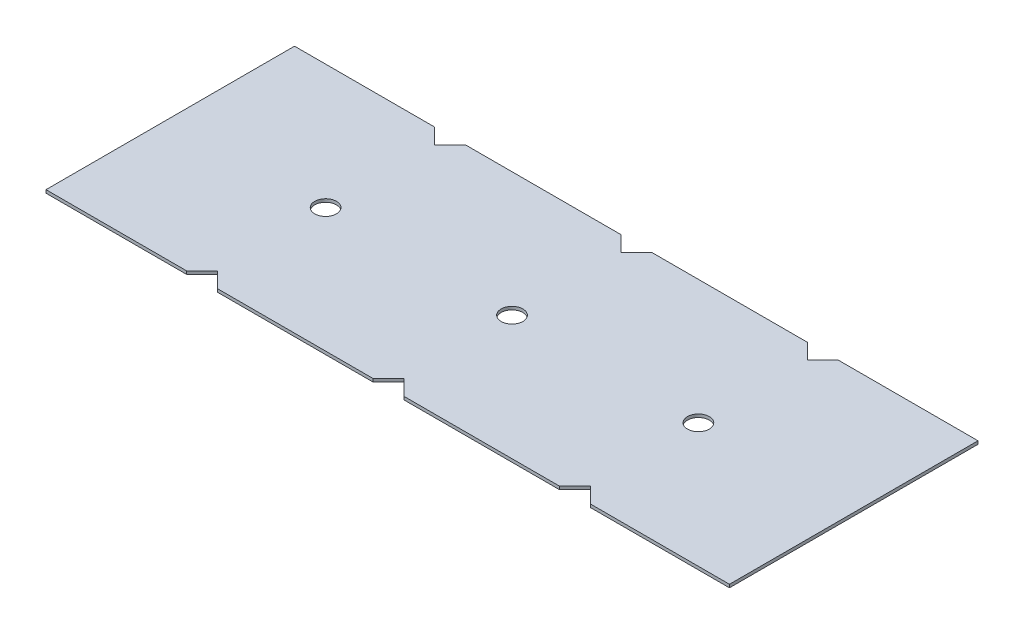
ISO-10303-21;
HEADER;
FILE_DESCRIPTION(('STEP AP214'),'2;1');
FILE_NAME('part.step','',(''),(''),'','','');
FILE_SCHEMA(('AUTOMOTIVE_DESIGN { 1 0 10303 214 1 1 1 1 }'));
ENDSEC;
DATA;
#1=APPLICATION_CONTEXT('core data for automotive mechanical design processes');
#2=APPLICATION_PROTOCOL_DEFINITION('international standard','automotive_design',2000,#1);
#3=PRODUCT_CONTEXT('',#1,'mechanical');
#4=PRODUCT('Part','Part','',(#3));
#5=PRODUCT_RELATED_PRODUCT_CATEGORY('part','',(#4));
#6=PRODUCT_DEFINITION_FORMATION('','',#4);
#7=PRODUCT_DEFINITION_CONTEXT('part definition',#1,'design');
#8=PRODUCT_DEFINITION('design','',#6,#7);
#9=PRODUCT_DEFINITION_SHAPE('','',#8);
#10=(LENGTH_UNIT() NAMED_UNIT(*) SI_UNIT(.MILLI.,.METRE.));
#11=(NAMED_UNIT(*) PLANE_ANGLE_UNIT() SI_UNIT($,.RADIAN.));
#12=(NAMED_UNIT(*) SI_UNIT($,.STERADIAN.) SOLID_ANGLE_UNIT());
#13=UNCERTAINTY_MEASURE_WITH_UNIT(LENGTH_MEASURE(1.E-05),#10,'distance_accuracy_value','');
#14=(GEOMETRIC_REPRESENTATION_CONTEXT(3) GLOBAL_UNCERTAINTY_ASSIGNED_CONTEXT((#13)) GLOBAL_UNIT_ASSIGNED_CONTEXT((#10,
#11,#12)) REPRESENTATION_CONTEXT('',''));
#15=CARTESIAN_POINT('',(0.,0.,0.));
#16=DIRECTION('',(0.,0.,1.));
#17=DIRECTION('',(1.,0.,0.));
#18=AXIS2_PLACEMENT_3D('',#15,#16,#17);
#19=CARTESIAN_POINT('',(0.,1.,0.));
#20=DIRECTION('',(0.,0.,-1.));
#21=DIRECTION('',(-1.,0.,0.));
#22=AXIS2_PLACEMENT_3D('',#19,#20,#21);
#23=PLANE('',#22);
#24=DIRECTION('',(-1.,0.,0.));
#25=VECTOR('',#24,1.);
#26=CARTESIAN_POINT('',(0.,1.,0.));
#27=LINE('',#26,#25);
#28=CARTESIAN_POINT('',(105.280404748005,1.,0.));
#29=VERTEX_POINT('',#28);
#30=CARTESIAN_POINT('',(55.2804047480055,1.,0.));
#31=VERTEX_POINT('',#30);
#32=EDGE_CURVE('E344',#29,#31,#27,.T.);
#33=ORIENTED_EDGE('',*,*,#32,.T.);
#34=DIRECTION('',(0.,1.,0.));
#35=VECTOR('',#34,1.);
#36=CARTESIAN_POINT('',(55.2804047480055,0.,0.));
#37=LINE('',#36,#35);
#38=CARTESIAN_POINT('',(55.2804047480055,0.,0.));
#39=VERTEX_POINT('',#38);
#40=EDGE_CURVE('E327',#39,#31,#37,.T.);
#41=ORIENTED_EDGE('',*,*,#40,.F.);
#42=DIRECTION('',(1.,0.,0.));
#43=VECTOR('',#42,1.);
#44=CARTESIAN_POINT('',(0.,0.,0.));
#45=LINE('',#44,#43);
#46=CARTESIAN_POINT('',(105.280404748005,0.,0.));
#47=VERTEX_POINT('',#46);
#48=EDGE_CURVE('E203',#39,#47,#45,.T.);
#49=ORIENTED_EDGE('',*,*,#48,.T.);
#50=DIRECTION('',(0.,1.,0.));
#51=VECTOR('',#50,1.);
#52=CARTESIAN_POINT('',(105.280404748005,0.,0.));
#53=LINE('',#52,#51);
#54=EDGE_CURVE('E296',#47,#29,#53,.T.);
#55=ORIENTED_EDGE('',*,*,#54,.T.);
#56=EDGE_LOOP('',(#33,#41,#49,#55));
#57=FACE_BOUND('',#56,.T.);
#58=ADVANCED_FACE('F31',(#57),#23,.F.);
#59=CARTESIAN_POINT('',(220.,1.,0.));
#60=VERTEX_POINT('',#59);
#61=CARTESIAN_POINT('',(175.280404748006,1.,0.));
#62=VERTEX_POINT('',#61);
#63=EDGE_CURVE('E347',#60,#62,#27,.T.);
#64=ORIENTED_EDGE('',*,*,#63,.T.);
#65=DIRECTION('',(0.,1.,0.));
#66=VECTOR('',#65,1.);
#67=CARTESIAN_POINT('',(175.280404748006,0.,0.));
#68=LINE('',#67,#66);
#69=CARTESIAN_POINT('',(175.280404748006,0.,0.));
#70=VERTEX_POINT('',#69);
#71=EDGE_CURVE('E312',#70,#62,#68,.T.);
#72=ORIENTED_EDGE('',*,*,#71,.F.);
#73=CARTESIAN_POINT('',(220.,0.,0.));
#74=VERTEX_POINT('',#73);
#75=EDGE_CURVE('E209',#70,#74,#45,.T.);
#76=ORIENTED_EDGE('',*,*,#75,.T.);
#77=DIRECTION('',(0.,1.,0.));
#78=VECTOR('',#77,1.);
#79=CARTESIAN_POINT('',(220.,0.,0.));
#80=LINE('',#79,#78);
#81=EDGE_CURVE('E202',#74,#60,#80,.T.);
#82=ORIENTED_EDGE('',*,*,#81,.T.);
#83=EDGE_LOOP('',(#64,#72,#76,#82));
#84=FACE_BOUND('',#83,.T.);
#85=ADVANCED_FACE('F416',(#84),#23,.F.);
#86=CARTESIAN_POINT('',(115.280404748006,0.,0.));
#87=VERTEX_POINT('',#86);
#88=CARTESIAN_POINT('',(165.280404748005,0.,0.));
#89=VERTEX_POINT('',#88);
#90=EDGE_CURVE('E205',#87,#89,#45,.T.);
#91=ORIENTED_EDGE('',*,*,#90,.T.);
#92=DIRECTION('',(0.,1.,0.));
#93=VECTOR('',#92,1.);
#94=CARTESIAN_POINT('',(165.280404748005,0.,0.));
#95=LINE('',#94,#93);
#96=CARTESIAN_POINT('',(165.280404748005,1.,0.));
#97=VERTEX_POINT('',#96);
#98=EDGE_CURVE('E56',#89,#97,#95,.T.);
#99=ORIENTED_EDGE('',*,*,#98,.T.);
#100=CARTESIAN_POINT('',(115.280404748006,1.,0.));
#101=VERTEX_POINT('',#100);
#102=EDGE_CURVE('E346',#97,#101,#27,.T.);
#103=ORIENTED_EDGE('',*,*,#102,.T.);
#104=DIRECTION('',(0.,1.,0.));
#105=VECTOR('',#104,1.);
#106=CARTESIAN_POINT('',(115.280404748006,0.,0.));
#107=LINE('',#106,#105);
#108=EDGE_CURVE('E293',#87,#101,#107,.T.);
#109=ORIENTED_EDGE('',*,*,#108,.F.);
#110=EDGE_LOOP('',(#91,#99,#103,#109));
#111=FACE_BOUND('',#110,.T.);
#112=ADVANCED_FACE('F424',(#111),#23,.F.);
#113=CARTESIAN_POINT('',(0.,1.,-80.));
#114=DIRECTION('',(0.,0.,-1.));
#115=DIRECTION('',(-1.,0.,0.));
#116=AXIS2_PLACEMENT_3D('',#113,#114,#115);
#117=PLANE('',#116);
#118=DIRECTION('',(0.,1.,0.));
#119=VECTOR('',#118,1.);
#120=CARTESIAN_POINT('',(55.0794565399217,0.,-80.));
#121=LINE('',#120,#119);
#122=CARTESIAN_POINT('',(55.0794565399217,0.,-80.));
#123=VERTEX_POINT('',#122);
#124=CARTESIAN_POINT('',(55.0794565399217,1.,-80.));
#125=VERTEX_POINT('',#124);
#126=EDGE_CURVE('E278',#123,#125,#121,.T.);
#127=ORIENTED_EDGE('',*,*,#126,.T.);
#128=DIRECTION('',(-1.,0.,0.));
#129=VECTOR('',#128,1.);
#130=CARTESIAN_POINT('',(0.,1.,-80.));
#131=LINE('',#130,#129);
#132=CARTESIAN_POINT('',(105.079456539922,1.,-80.));
#133=VERTEX_POINT('',#132);
#134=EDGE_CURVE('E369',#133,#125,#131,.T.);
#135=ORIENTED_EDGE('',*,*,#134,.F.);
#136=DIRECTION('',(0.,1.,0.));
#137=VECTOR('',#136,1.);
#138=CARTESIAN_POINT('',(105.079456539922,0.,-80.));
#139=LINE('',#138,#137);
#140=CARTESIAN_POINT('',(105.079456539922,0.,-80.));
#141=VERTEX_POINT('',#140);
#142=EDGE_CURVE('E239',#141,#133,#139,.T.);
#143=ORIENTED_EDGE('',*,*,#142,.F.);
#144=DIRECTION('',(1.,0.,0.));
#145=VECTOR('',#144,1.);
#146=CARTESIAN_POINT('',(0.,0.,-80.));
#147=LINE('',#146,#145);
#148=EDGE_CURVE('E358',#123,#141,#147,.T.);
#149=ORIENTED_EDGE('',*,*,#148,.F.);
#150=EDGE_LOOP('',(#127,#135,#143,#149));
#151=FACE_BOUND('',#150,.T.);
#152=ADVANCED_FACE('F391',(#151),#117,.T.);
#153=DIRECTION('',(0.,1.,0.));
#154=VECTOR('',#153,1.);
#155=CARTESIAN_POINT('',(175.079456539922,0.,-80.));
#156=LINE('',#155,#154);
#157=CARTESIAN_POINT('',(175.079456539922,0.,-80.));
#158=VERTEX_POINT('',#157);
#159=CARTESIAN_POINT('',(175.079456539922,1.,-80.));
#160=VERTEX_POINT('',#159);
#161=EDGE_CURVE('E260',#158,#160,#156,.T.);
#162=ORIENTED_EDGE('',*,*,#161,.T.);
#163=CARTESIAN_POINT('',(220.,1.,-80.));
#164=VERTEX_POINT('',#163);
#165=EDGE_CURVE('E366',#164,#160,#131,.T.);
#166=ORIENTED_EDGE('',*,*,#165,.F.);
#167=DIRECTION('',(0.,1.,0.));
#168=VECTOR('',#167,1.);
#169=CARTESIAN_POINT('',(220.,0.,-80.));
#170=LINE('',#169,#168);
#171=CARTESIAN_POINT('',(220.,0.,-80.));
#172=VERTEX_POINT('',#171);
#173=EDGE_CURVE('E362',#172,#164,#170,.T.);
#174=ORIENTED_EDGE('',*,*,#173,.F.);
#175=EDGE_CURVE('E353',#158,#172,#147,.T.);
#176=ORIENTED_EDGE('',*,*,#175,.F.);
#177=EDGE_LOOP('',(#162,#166,#174,#176));
#178=FACE_BOUND('',#177,.T.);
#179=ADVANCED_FACE('F412',(#178),#117,.T.);
#180=DIRECTION('',(0.,1.,0.));
#181=VECTOR('',#180,1.);
#182=CARTESIAN_POINT('',(165.079456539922,0.,-80.));
#183=LINE('',#182,#181);
#184=CARTESIAN_POINT('',(165.079456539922,0.,-80.));
#185=VERTEX_POINT('',#184);
#186=CARTESIAN_POINT('',(165.079456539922,1.,-80.));
#187=VERTEX_POINT('',#186);
#188=EDGE_CURVE('E265',#185,#187,#183,.T.);
#189=ORIENTED_EDGE('',*,*,#188,.F.);
#190=CARTESIAN_POINT('',(115.079456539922,0.,-80.));
#191=VERTEX_POINT('',#190);
#192=EDGE_CURVE('E356',#191,#185,#147,.T.);
#193=ORIENTED_EDGE('',*,*,#192,.F.);
#194=DIRECTION('',(0.,1.,0.));
#195=VECTOR('',#194,1.);
#196=CARTESIAN_POINT('',(115.079456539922,0.,-80.));
#197=LINE('',#196,#195);
#198=CARTESIAN_POINT('',(115.079456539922,1.,-80.));
#199=VERTEX_POINT('',#198);
#200=EDGE_CURVE('E238',#191,#199,#197,.T.);
#201=ORIENTED_EDGE('',*,*,#200,.T.);
#202=EDGE_CURVE('E368',#187,#199,#131,.T.);
#203=ORIENTED_EDGE('',*,*,#202,.F.);
#204=EDGE_LOOP('',(#189,#193,#201,#203));
#205=FACE_BOUND('',#204,.T.);
#206=ADVANCED_FACE('F399',(#205),#117,.T.);
#207=CARTESIAN_POINT('',(0.,0.,-80.));
#208=DIRECTION('',(-1.,0.,0.));
#209=DIRECTION('',(0.,0.,1.));
#210=AXIS2_PLACEMENT_3D('',#207,#208,#209);
#211=PLANE('',#210);
#212=DIRECTION('',(0.,-1.,0.));
#213=VECTOR('',#212,1.);
#214=CARTESIAN_POINT('',(0.,0.,0.));
#215=LINE('',#214,#213);
#216=CARTESIAN_POINT('',(0.,1.,0.));
#217=VERTEX_POINT('',#216);
#218=CARTESIAN_POINT('',(0.,0.,0.));
#219=VERTEX_POINT('',#218);
#220=EDGE_CURVE('E201',#217,#219,#215,.T.);
#221=ORIENTED_EDGE('',*,*,#220,.F.);
#222=DIRECTION('',(0.,0.,1.));
#223=VECTOR('',#222,1.);
#224=CARTESIAN_POINT('',(0.,1.,-80.));
#225=LINE('',#224,#223);
#226=CARTESIAN_POINT('',(0.,1.,-80.));
#227=VERTEX_POINT('',#226);
#228=EDGE_CURVE('E11',#227,#217,#225,.T.);
#229=ORIENTED_EDGE('',*,*,#228,.F.);
#230=DIRECTION('',(0.,-1.,0.));
#231=VECTOR('',#230,1.);
#232=CARTESIAN_POINT('',(0.,0.,-80.));
#233=LINE('',#232,#231);
#234=CARTESIAN_POINT('',(0.,0.,-80.));
#235=VERTEX_POINT('',#234);
#236=EDGE_CURVE('E350',#227,#235,#233,.T.);
#237=ORIENTED_EDGE('',*,*,#236,.T.);
#238=DIRECTION('',(0.,0.,1.));
#239=VECTOR('',#238,1.);
#240=CARTESIAN_POINT('',(0.,0.,-80.));
#241=LINE('',#240,#239);
#242=EDGE_CURVE('E35',#235,#219,#241,.T.);
#243=ORIENTED_EDGE('',*,*,#242,.T.);
#244=EDGE_LOOP('',(#221,#229,#237,#243));
#245=FACE_BOUND('',#244,.T.);
#246=ADVANCED_FACE('F33',(#245),#211,.T.);
#247=CARTESIAN_POINT('',(0.,1.,-80.));
#248=DIRECTION('',(0.,1.,0.));
#249=DIRECTION('',(0.,0.,1.));
#250=AXIS2_PLACEMENT_3D('',#247,#248,#249);
#251=PLANE('',#250);
#252=DIRECTION('',(-0.707106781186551,0.,-0.707106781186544));
#253=VECTOR('',#252,1.);
#254=CARTESIAN_POINT('',(50.2804047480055,1.,-5.00000000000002));
#255=LINE('',#254,#253);
#256=CARTESIAN_POINT('',(50.2804047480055,1.,-5.00000000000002));
#257=VERTEX_POINT('',#256);
#258=EDGE_CURVE('E330',#31,#257,#255,.T.);
#259=ORIENTED_EDGE('',*,*,#258,.F.);
#260=ORIENTED_EDGE('',*,*,#32,.F.);
#261=DIRECTION('',(-0.707106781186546,0.,0.707106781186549));
#262=VECTOR('',#261,1.);
#263=CARTESIAN_POINT('',(110.280404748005,1.,-5.00000000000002));
#264=LINE('',#263,#262);
#265=CARTESIAN_POINT('',(110.280404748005,1.,-5.00000000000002));
#266=VERTEX_POINT('',#265);
#267=EDGE_CURVE('E307',#266,#29,#264,.T.);
#268=ORIENTED_EDGE('',*,*,#267,.F.);
#269=DIRECTION('',(-0.707106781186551,0.,-0.707106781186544));
#270=VECTOR('',#269,1.);
#271=CARTESIAN_POINT('',(110.280404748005,1.,-5.00000000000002));
#272=LINE('',#271,#270);
#273=EDGE_CURVE('E309',#101,#266,#272,.T.);
#274=ORIENTED_EDGE('',*,*,#273,.F.);
#275=ORIENTED_EDGE('',*,*,#102,.F.);
#276=DIRECTION('',(-0.707106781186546,0.,0.707106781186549));
#277=VECTOR('',#276,1.);
#278=CARTESIAN_POINT('',(170.280404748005,1.,-5.00000000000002));
#279=LINE('',#278,#277);
#280=CARTESIAN_POINT('',(170.280404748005,1.,-5.00000000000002));
#281=VERTEX_POINT('',#280);
#282=EDGE_CURVE('E325',#281,#97,#279,.T.);
#283=ORIENTED_EDGE('',*,*,#282,.F.);
#284=DIRECTION('',(-0.707106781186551,0.,-0.707106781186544));
#285=VECTOR('',#284,1.);
#286=CARTESIAN_POINT('',(170.280404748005,1.,-5.00000000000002));
#287=LINE('',#286,#285);
#288=EDGE_CURVE('E317',#62,#281,#287,.T.);
#289=ORIENTED_EDGE('',*,*,#288,.F.);
#290=ORIENTED_EDGE('',*,*,#63,.F.);
#291=DIRECTION('',(0.,0.,1.));
#292=VECTOR('',#291,1.);
#293=CARTESIAN_POINT('',(220.,1.,-80.));
#294=LINE('',#293,#292);
#295=EDGE_CURVE('E40',#164,#60,#294,.T.);
#296=ORIENTED_EDGE('',*,*,#295,.F.);
#297=ORIENTED_EDGE('',*,*,#165,.T.);
#298=DIRECTION('',(0.707106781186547,0.,-0.707106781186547));
#299=VECTOR('',#298,1.);
#300=CARTESIAN_POINT('',(175.079456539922,1.,-80.));
#301=LINE('',#300,#299);
#302=CARTESIAN_POINT('',(170.079456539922,1.,-75.));
#303=VERTEX_POINT('',#302);
#304=EDGE_CURVE('E263',#303,#160,#301,.T.);
#305=ORIENTED_EDGE('',*,*,#304,.F.);
#306=DIRECTION('',(0.707106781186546,0.,0.707106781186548));
#307=VECTOR('',#306,1.);
#308=CARTESIAN_POINT('',(170.079456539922,1.,-75.));
#309=LINE('',#308,#307);
#310=EDGE_CURVE('E273',#187,#303,#309,.T.);
#311=ORIENTED_EDGE('',*,*,#310,.F.);
#312=ORIENTED_EDGE('',*,*,#202,.T.);
#313=DIRECTION('',(0.707106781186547,0.,-0.707106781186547));
#314=VECTOR('',#313,1.);
#315=CARTESIAN_POINT('',(115.079456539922,1.,-80.));
#316=LINE('',#315,#314);
#317=CARTESIAN_POINT('',(110.079456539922,1.,-75.));
#318=VERTEX_POINT('',#317);
#319=EDGE_CURVE('E251',#318,#199,#316,.T.);
#320=ORIENTED_EDGE('',*,*,#319,.F.);
#321=DIRECTION('',(0.707106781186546,0.,0.707106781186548));
#322=VECTOR('',#321,1.);
#323=CARTESIAN_POINT('',(110.079456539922,1.,-75.));
#324=LINE('',#323,#322);
#325=EDGE_CURVE('E254',#133,#318,#324,.T.);
#326=ORIENTED_EDGE('',*,*,#325,.F.);
#327=ORIENTED_EDGE('',*,*,#134,.T.);
#328=DIRECTION('',(0.707106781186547,0.,-0.707106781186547));
#329=VECTOR('',#328,1.);
#330=CARTESIAN_POINT('',(55.0794565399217,1.,-80.));
#331=LINE('',#330,#329);
#332=CARTESIAN_POINT('',(50.0794565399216,1.,-75.));
#333=VERTEX_POINT('',#332);
#334=EDGE_CURVE('E281',#333,#125,#331,.T.);
#335=ORIENTED_EDGE('',*,*,#334,.F.);
#336=DIRECTION('',(0.707106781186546,0.,0.707106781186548));
#337=VECTOR('',#336,1.);
#338=CARTESIAN_POINT('',(50.0794565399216,1.,-75.));
#339=LINE('',#338,#337);
#340=CARTESIAN_POINT('',(45.0794565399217,1.,-80.));
#341=VERTEX_POINT('',#340);
#342=EDGE_CURVE('E291',#341,#333,#339,.T.);
#343=ORIENTED_EDGE('',*,*,#342,.F.);
#344=EDGE_CURVE('E365',#341,#227,#131,.T.);
#345=ORIENTED_EDGE('',*,*,#344,.T.);
#346=ORIENTED_EDGE('',*,*,#228,.T.);
#347=CARTESIAN_POINT('',(45.2804047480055,1.,0.));
#348=VERTEX_POINT('',#347);
#349=EDGE_CURVE('E207',#348,#217,#27,.T.);
#350=ORIENTED_EDGE('',*,*,#349,.F.);
#351=DIRECTION('',(-0.707106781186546,0.,0.707106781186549));
#352=VECTOR('',#351,1.);
#353=CARTESIAN_POINT('',(50.2804047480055,1.,-5.00000000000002));
#354=LINE('',#353,#352);
#355=EDGE_CURVE('E48',#257,#348,#354,.T.);
#356=ORIENTED_EDGE('',*,*,#355,.F.);
#357=EDGE_LOOP('',(#259,#260,#268,#274,#275,#283,#289,#290,#296,#297,#305,#311,#312,#320,#326,
#327,#335,#343,#345,#346,#350,#356));
#358=FACE_BOUND('',#357,.T.);
#359=CARTESIAN_POINT('',(50.,1.,-40.));
#360=DIRECTION('',(0.,1.,0.));
#361=DIRECTION('',(0.,0.,1.));
#362=AXIS2_PLACEMENT_3D('',#359,#360,#361);
#363=CIRCLE('',#362,3.50000000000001);
#364=CARTESIAN_POINT('',(50.,1.,-36.5));
#365=VERTEX_POINT('',#364);
#366=EDGE_CURVE('E232',#365,#365,#363,.T.);
#367=ORIENTED_EDGE('',*,*,#366,.F.);
#368=EDGE_LOOP('',(#367));
#369=FACE_BOUND('',#368,.T.);
#370=CARTESIAN_POINT('',(170.,1.,-40.));
#371=DIRECTION('',(0.,1.,0.));
#372=DIRECTION('',(0.,0.,1.));
#373=AXIS2_PLACEMENT_3D('',#370,#371,#372);
#374=CIRCLE('',#373,3.50000000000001);
#375=CARTESIAN_POINT('',(170.,1.,-36.5));
#376=VERTEX_POINT('',#375);
#377=EDGE_CURVE('E226',#376,#376,#374,.T.);
#378=ORIENTED_EDGE('',*,*,#377,.F.);
#379=EDGE_LOOP('',(#378));
#380=FACE_BOUND('',#379,.T.);
#381=CARTESIAN_POINT('',(110.,1.,-40.));
#382=DIRECTION('',(0.,1.,0.));
#383=DIRECTION('',(0.,0.,1.));
#384=AXIS2_PLACEMENT_3D('',#381,#382,#383);
#385=CIRCLE('',#384,3.50000000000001);
#386=CARTESIAN_POINT('',(110.,1.,-36.5));
#387=VERTEX_POINT('',#386);
#388=EDGE_CURVE('E221',#387,#387,#385,.T.);
#389=ORIENTED_EDGE('',*,*,#388,.F.);
#390=EDGE_LOOP('',(#389));
#391=FACE_BOUND('',#390,.T.);
#392=ADVANCED_FACE('F341',(#358,#369,#380,#391),#251,.T.);
#393=CARTESIAN_POINT('',(220.,0.,-80.));
#394=DIRECTION('',(1.,0.,0.));
#395=DIRECTION('',(0.,0.,-1.));
#396=AXIS2_PLACEMENT_3D('',#393,#394,#395);
#397=PLANE('',#396);
#398=ORIENTED_EDGE('',*,*,#81,.F.);
#399=DIRECTION('',(0.,0.,1.));
#400=VECTOR('',#399,1.);
#401=CARTESIAN_POINT('',(220.,0.,-80.));
#402=LINE('',#401,#400);
#403=EDGE_CURVE('E371',#172,#74,#402,.T.);
#404=ORIENTED_EDGE('',*,*,#403,.F.);
#405=ORIENTED_EDGE('',*,*,#173,.T.);
#406=ORIENTED_EDGE('',*,*,#295,.T.);
#407=EDGE_LOOP('',(#398,#404,#405,#406));
#408=FACE_BOUND('',#407,.T.);
#409=ADVANCED_FACE('F415',(#408),#397,.T.);
#410=CARTESIAN_POINT('',(0.,0.,-80.));
#411=DIRECTION('',(0.,-1.,0.));
#412=DIRECTION('',(0.,0.,-1.));
#413=AXIS2_PLACEMENT_3D('',#410,#411,#412);
#414=PLANE('',#413);
#415=DIRECTION('',(-0.707106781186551,0.,-0.707106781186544));
#416=VECTOR('',#415,1.);
#417=CARTESIAN_POINT('',(50.2804047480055,0.,-5.00000000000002));
#418=LINE('',#417,#416);
#419=CARTESIAN_POINT('',(50.2804047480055,0.,-5.00000000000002));
#420=VERTEX_POINT('',#419);
#421=EDGE_CURVE('E196',#39,#420,#418,.T.);
#422=ORIENTED_EDGE('',*,*,#421,.T.);
#423=DIRECTION('',(-0.707106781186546,0.,0.707106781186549));
#424=VECTOR('',#423,1.);
#425=CARTESIAN_POINT('',(50.2804047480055,0.,-5.00000000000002));
#426=LINE('',#425,#424);
#427=CARTESIAN_POINT('',(45.2804047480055,0.,0.));
#428=VERTEX_POINT('',#427);
#429=EDGE_CURVE('E182',#420,#428,#426,.T.);
#430=ORIENTED_EDGE('',*,*,#429,.T.);
#431=EDGE_CURVE('E193',#219,#428,#45,.T.);
#432=ORIENTED_EDGE('',*,*,#431,.F.);
#433=ORIENTED_EDGE('',*,*,#242,.F.);
#434=CARTESIAN_POINT('',(45.0794565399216,0.,-80.));
#435=VERTEX_POINT('',#434);
#436=EDGE_CURVE('E359',#235,#435,#147,.T.);
#437=ORIENTED_EDGE('',*,*,#436,.T.);
#438=DIRECTION('',(0.707106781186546,0.,0.707106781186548));
#439=VECTOR('',#438,1.);
#440=CARTESIAN_POINT('',(50.0794565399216,0.,-75.));
#441=LINE('',#440,#439);
#442=CARTESIAN_POINT('',(50.0794565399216,0.,-75.));
#443=VERTEX_POINT('',#442);
#444=EDGE_CURVE('E285',#435,#443,#441,.T.);
#445=ORIENTED_EDGE('',*,*,#444,.T.);
#446=DIRECTION('',(0.707106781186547,0.,-0.707106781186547));
#447=VECTOR('',#446,1.);
#448=CARTESIAN_POINT('',(55.0794565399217,0.,-80.));
#449=LINE('',#448,#447);
#450=EDGE_CURVE('E275',#443,#123,#449,.T.);
#451=ORIENTED_EDGE('',*,*,#450,.T.);
#452=ORIENTED_EDGE('',*,*,#148,.T.);
#453=DIRECTION('',(0.707106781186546,0.,0.707106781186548));
#454=VECTOR('',#453,1.);
#455=CARTESIAN_POINT('',(110.079456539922,0.,-75.));
#456=LINE('',#455,#454);
#457=CARTESIAN_POINT('',(110.079456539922,0.,-75.));
#458=VERTEX_POINT('',#457);
#459=EDGE_CURVE('E248',#141,#458,#456,.T.);
#460=ORIENTED_EDGE('',*,*,#459,.T.);
#461=DIRECTION('',(0.707106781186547,0.,-0.707106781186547));
#462=VECTOR('',#461,1.);
#463=CARTESIAN_POINT('',(115.079456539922,0.,-80.));
#464=LINE('',#463,#462);
#465=EDGE_CURVE('E242',#458,#191,#464,.T.);
#466=ORIENTED_EDGE('',*,*,#465,.T.);
#467=ORIENTED_EDGE('',*,*,#192,.T.);
#468=DIRECTION('',(0.707106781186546,0.,0.707106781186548));
#469=VECTOR('',#468,1.);
#470=CARTESIAN_POINT('',(170.079456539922,0.,-75.));
#471=LINE('',#470,#469);
#472=CARTESIAN_POINT('',(170.079456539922,0.,-75.));
#473=VERTEX_POINT('',#472);
#474=EDGE_CURVE('E267',#185,#473,#471,.T.);
#475=ORIENTED_EDGE('',*,*,#474,.T.);
#476=DIRECTION('',(0.707106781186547,0.,-0.707106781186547));
#477=VECTOR('',#476,1.);
#478=CARTESIAN_POINT('',(175.079456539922,0.,-80.));
#479=LINE('',#478,#477);
#480=EDGE_CURVE('E257',#473,#158,#479,.T.);
#481=ORIENTED_EDGE('',*,*,#480,.T.);
#482=ORIENTED_EDGE('',*,*,#175,.T.);
#483=ORIENTED_EDGE('',*,*,#403,.T.);
#484=ORIENTED_EDGE('',*,*,#75,.F.);
#485=DIRECTION('',(-0.707106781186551,0.,-0.707106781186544));
#486=VECTOR('',#485,1.);
#487=CARTESIAN_POINT('',(170.280404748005,0.,-5.00000000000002));
#488=LINE('',#487,#486);
#489=CARTESIAN_POINT('',(170.280404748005,0.,-5.00000000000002));
#490=VERTEX_POINT('',#489);
#491=EDGE_CURVE('E314',#70,#490,#488,.T.);
#492=ORIENTED_EDGE('',*,*,#491,.T.);
#493=DIRECTION('',(-0.707106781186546,0.,0.707106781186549));
#494=VECTOR('',#493,1.);
#495=CARTESIAN_POINT('',(170.280404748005,0.,-5.00000000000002));
#496=LINE('',#495,#494);
#497=EDGE_CURVE('E322',#490,#89,#496,.T.);
#498=ORIENTED_EDGE('',*,*,#497,.T.);
#499=ORIENTED_EDGE('',*,*,#90,.F.);
#500=DIRECTION('',(-0.707106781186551,0.,-0.707106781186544));
#501=VECTOR('',#500,1.);
#502=CARTESIAN_POINT('',(110.280404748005,0.,-5.00000000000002));
#503=LINE('',#502,#501);
#504=CARTESIAN_POINT('',(110.280404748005,0.,-5.00000000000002));
#505=VERTEX_POINT('',#504);
#506=EDGE_CURVE('E304',#87,#505,#503,.T.);
#507=ORIENTED_EDGE('',*,*,#506,.T.);
#508=DIRECTION('',(-0.707106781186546,0.,0.707106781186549));
#509=VECTOR('',#508,1.);
#510=CARTESIAN_POINT('',(110.280404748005,0.,-5.00000000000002));
#511=LINE('',#510,#509);
#512=EDGE_CURVE('E297',#505,#47,#511,.T.);
#513=ORIENTED_EDGE('',*,*,#512,.T.);
#514=ORIENTED_EDGE('',*,*,#48,.F.);
#515=EDGE_LOOP('',(#422,#430,#432,#433,#437,#445,#451,#452,#460,#466,#467,#475,#481,#482,#483,
#484,#492,#498,#499,#507,#513,#514));
#516=FACE_BOUND('',#515,.T.);
#517=CARTESIAN_POINT('',(50.,0.,-40.));
#518=DIRECTION('',(0.,1.,0.));
#519=DIRECTION('',(0.,0.,1.));
#520=AXIS2_PLACEMENT_3D('',#517,#518,#519);
#521=CIRCLE('',#520,3.50000000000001);
#522=CARTESIAN_POINT('',(50.,0.,-36.5));
#523=VERTEX_POINT('',#522);
#524=EDGE_CURVE('E235',#523,#523,#521,.T.);
#525=ORIENTED_EDGE('',*,*,#524,.T.);
#526=EDGE_LOOP('',(#525));
#527=FACE_BOUND('',#526,.T.);
#528=CARTESIAN_POINT('',(170.,0.,-40.));
#529=DIRECTION('',(0.,1.,0.));
#530=DIRECTION('',(0.,0.,1.));
#531=AXIS2_PLACEMENT_3D('',#528,#529,#530);
#532=CIRCLE('',#531,3.50000000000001);
#533=CARTESIAN_POINT('',(170.,0.,-36.5));
#534=VERTEX_POINT('',#533);
#535=EDGE_CURVE('E229',#534,#534,#532,.T.);
#536=ORIENTED_EDGE('',*,*,#535,.T.);
#537=EDGE_LOOP('',(#536));
#538=FACE_BOUND('',#537,.T.);
#539=CARTESIAN_POINT('',(110.,0.,-40.));
#540=DIRECTION('',(0.,1.,0.));
#541=DIRECTION('',(0.,0.,1.));
#542=AXIS2_PLACEMENT_3D('',#539,#540,#541);
#543=CIRCLE('',#542,3.50000000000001);
#544=CARTESIAN_POINT('',(110.,0.,-36.5));
#545=VERTEX_POINT('',#544);
#546=EDGE_CURVE('E219',#545,#545,#543,.T.);
#547=ORIENTED_EDGE('',*,*,#546,.T.);
#548=EDGE_LOOP('',(#547));
#549=FACE_BOUND('',#548,.T.);
#550=ADVANCED_FACE('F191',(#516,#527,#538,#549),#414,.T.);
#551=DIRECTION('',(0.,1.,0.));
#552=VECTOR('',#551,1.);
#553=CARTESIAN_POINT('',(45.0794565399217,0.,-80.));
#554=LINE('',#553,#552);
#555=EDGE_CURVE('E283',#435,#341,#554,.T.);
#556=ORIENTED_EDGE('',*,*,#555,.F.);
#557=ORIENTED_EDGE('',*,*,#436,.F.);
#558=ORIENTED_EDGE('',*,*,#236,.F.);
#559=ORIENTED_EDGE('',*,*,#344,.F.);
#560=EDGE_LOOP('',(#556,#557,#558,#559));
#561=FACE_BOUND('',#560,.T.);
#562=ADVANCED_FACE('F377',(#561),#117,.T.);
#563=ORIENTED_EDGE('',*,*,#431,.T.);
#564=DIRECTION('',(0.,1.,0.));
#565=VECTOR('',#564,1.);
#566=CARTESIAN_POINT('',(45.2804047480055,0.,0.));
#567=LINE('',#566,#565);
#568=EDGE_CURVE('E179',#428,#348,#567,.T.);
#569=ORIENTED_EDGE('',*,*,#568,.T.);
#570=ORIENTED_EDGE('',*,*,#349,.T.);
#571=ORIENTED_EDGE('',*,*,#220,.T.);
#572=EDGE_LOOP('',(#563,#569,#570,#571));
#573=FACE_BOUND('',#572,.T.);
#574=ADVANCED_FACE('F199',(#573),#23,.F.);
#575=CARTESIAN_POINT('',(110.,0.,-40.));
#576=DIRECTION('',(0.,1.,0.));
#577=DIRECTION('',(0.,0.,1.));
#578=AXIS2_PLACEMENT_3D('',#575,#576,#577);
#579=CYLINDRICAL_SURFACE('',#578,3.50000000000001);
#580=ORIENTED_EDGE('',*,*,#546,.F.);
#581=EDGE_LOOP('',(#580));
#582=FACE_BOUND('',#581,.T.);
#583=ORIENTED_EDGE('',*,*,#388,.T.);
#584=EDGE_LOOP('',(#583));
#585=FACE_BOUND('',#584,.T.);
#586=ADVANCED_FACE('F443',(#582,#585),#579,.F.);
#587=CARTESIAN_POINT('',(170.,0.,-40.));
#588=DIRECTION('',(0.,1.,0.));
#589=DIRECTION('',(0.,0.,1.));
#590=AXIS2_PLACEMENT_3D('',#587,#588,#589);
#591=CYLINDRICAL_SURFACE('',#590,3.50000000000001);
#592=ORIENTED_EDGE('',*,*,#535,.F.);
#593=EDGE_LOOP('',(#592));
#594=FACE_BOUND('',#593,.T.);
#595=ORIENTED_EDGE('',*,*,#377,.T.);
#596=EDGE_LOOP('',(#595));
#597=FACE_BOUND('',#596,.T.);
#598=ADVANCED_FACE('F449',(#594,#597),#591,.F.);
#599=CARTESIAN_POINT('',(50.,0.,-40.));
#600=DIRECTION('',(0.,1.,0.));
#601=DIRECTION('',(0.,0.,1.));
#602=AXIS2_PLACEMENT_3D('',#599,#600,#601);
#603=CYLINDRICAL_SURFACE('',#602,3.50000000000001);
#604=ORIENTED_EDGE('',*,*,#524,.F.);
#605=EDGE_LOOP('',(#604));
#606=FACE_BOUND('',#605,.T.);
#607=ORIENTED_EDGE('',*,*,#366,.T.);
#608=EDGE_LOOP('',(#607));
#609=FACE_BOUND('',#608,.T.);
#610=ADVANCED_FACE('F490',(#606,#609),#603,.F.);
#611=CARTESIAN_POINT('',(115.079456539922,0.,-80.));
#612=DIRECTION('',(0.707106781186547,0.,0.707106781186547));
#613=DIRECTION('',(0.707106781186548,0.,-0.707106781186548));
#614=AXIS2_PLACEMENT_3D('',#611,#612,#613);
#615=PLANE('',#614);
#616=ORIENTED_EDGE('',*,*,#319,.T.);
#617=ORIENTED_EDGE('',*,*,#200,.F.);
#618=ORIENTED_EDGE('',*,*,#465,.F.);
#619=DIRECTION('',(0.,1.,0.));
#620=VECTOR('',#619,1.);
#621=CARTESIAN_POINT('',(110.079456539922,0.,-75.));
#622=LINE('',#621,#620);
#623=EDGE_CURVE('E241',#458,#318,#622,.T.);
#624=ORIENTED_EDGE('',*,*,#623,.T.);
#625=EDGE_LOOP('',(#616,#617,#618,#624));
#626=FACE_BOUND('',#625,.T.);
#627=ADVANCED_FACE('F498',(#626),#615,.F.);
#628=CARTESIAN_POINT('',(110.079456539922,0.,-75.));
#629=DIRECTION('',(-0.707106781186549,0.,0.707106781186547));
#630=DIRECTION('',(0.707106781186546,0.,0.707106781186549));
#631=AXIS2_PLACEMENT_3D('',#628,#629,#630);
#632=PLANE('',#631);
#633=ORIENTED_EDGE('',*,*,#325,.T.);
#634=ORIENTED_EDGE('',*,*,#623,.F.);
#635=ORIENTED_EDGE('',*,*,#459,.F.);
#636=ORIENTED_EDGE('',*,*,#142,.T.);
#637=EDGE_LOOP('',(#633,#634,#635,#636));
#638=FACE_BOUND('',#637,.T.);
#639=ADVANCED_FACE('F506',(#638),#632,.F.);
#640=CARTESIAN_POINT('',(175.079456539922,0.,-80.));
#641=DIRECTION('',(0.707106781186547,0.,0.707106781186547));
#642=DIRECTION('',(0.707106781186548,0.,-0.707106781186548));
#643=AXIS2_PLACEMENT_3D('',#640,#641,#642);
#644=PLANE('',#643);
#645=ORIENTED_EDGE('',*,*,#304,.T.);
#646=ORIENTED_EDGE('',*,*,#161,.F.);
#647=ORIENTED_EDGE('',*,*,#480,.F.);
#648=DIRECTION('',(0.,1.,0.));
#649=VECTOR('',#648,1.);
#650=CARTESIAN_POINT('',(170.079456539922,0.,-75.));
#651=LINE('',#650,#649);
#652=EDGE_CURVE('E270',#473,#303,#651,.T.);
#653=ORIENTED_EDGE('',*,*,#652,.T.);
#654=EDGE_LOOP('',(#645,#646,#647,#653));
#655=FACE_BOUND('',#654,.T.);
#656=ADVANCED_FACE('F409',(#655),#644,.F.);
#657=CARTESIAN_POINT('',(170.079456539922,0.,-75.));
#658=DIRECTION('',(-0.707106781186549,0.,0.707106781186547));
#659=DIRECTION('',(0.707106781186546,0.,0.707106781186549));
#660=AXIS2_PLACEMENT_3D('',#657,#658,#659);
#661=PLANE('',#660);
#662=ORIENTED_EDGE('',*,*,#310,.T.);
#663=ORIENTED_EDGE('',*,*,#652,.F.);
#664=ORIENTED_EDGE('',*,*,#474,.F.);
#665=ORIENTED_EDGE('',*,*,#188,.T.);
#666=EDGE_LOOP('',(#662,#663,#664,#665));
#667=FACE_BOUND('',#666,.T.);
#668=ADVANCED_FACE('F403',(#667),#661,.F.);
#669=CARTESIAN_POINT('',(55.0794565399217,0.,-80.));
#670=DIRECTION('',(0.707106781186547,0.,0.707106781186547));
#671=DIRECTION('',(0.707106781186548,0.,-0.707106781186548));
#672=AXIS2_PLACEMENT_3D('',#669,#670,#671);
#673=PLANE('',#672);
#674=ORIENTED_EDGE('',*,*,#334,.T.);
#675=ORIENTED_EDGE('',*,*,#126,.F.);
#676=ORIENTED_EDGE('',*,*,#450,.F.);
#677=DIRECTION('',(0.,1.,0.));
#678=VECTOR('',#677,1.);
#679=CARTESIAN_POINT('',(50.0794565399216,0.,-75.));
#680=LINE('',#679,#678);
#681=EDGE_CURVE('E288',#443,#333,#680,.T.);
#682=ORIENTED_EDGE('',*,*,#681,.T.);
#683=EDGE_LOOP('',(#674,#675,#676,#682));
#684=FACE_BOUND('',#683,.T.);
#685=ADVANCED_FACE('F387',(#684),#673,.F.);
#686=CARTESIAN_POINT('',(50.0794565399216,0.,-75.));
#687=DIRECTION('',(-0.707106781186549,0.,0.707106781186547));
#688=DIRECTION('',(0.707106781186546,0.,0.707106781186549));
#689=AXIS2_PLACEMENT_3D('',#686,#687,#688);
#690=PLANE('',#689);
#691=ORIENTED_EDGE('',*,*,#342,.T.);
#692=ORIENTED_EDGE('',*,*,#681,.F.);
#693=ORIENTED_EDGE('',*,*,#444,.F.);
#694=ORIENTED_EDGE('',*,*,#555,.T.);
#695=EDGE_LOOP('',(#691,#692,#693,#694));
#696=FACE_BOUND('',#695,.T.);
#697=ADVANCED_FACE('F381',(#696),#690,.F.);
#698=CARTESIAN_POINT('',(110.280404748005,0.,-5.00000000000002));
#699=DIRECTION('',(0.707106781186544,0.,-0.707106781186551));
#700=DIRECTION('',(-0.707106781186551,0.,-0.707106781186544));
#701=AXIS2_PLACEMENT_3D('',#698,#699,#700);
#702=PLANE('',#701);
#703=ORIENTED_EDGE('',*,*,#273,.T.);
#704=DIRECTION('',(0.,1.,0.));
#705=VECTOR('',#704,1.);
#706=CARTESIAN_POINT('',(110.280404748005,0.,-5.00000000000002));
#707=LINE('',#706,#705);
#708=EDGE_CURVE('E294',#505,#266,#707,.T.);
#709=ORIENTED_EDGE('',*,*,#708,.F.);
#710=ORIENTED_EDGE('',*,*,#506,.F.);
#711=ORIENTED_EDGE('',*,*,#108,.T.);
#712=EDGE_LOOP('',(#703,#709,#710,#711));
#713=FACE_BOUND('',#712,.T.);
#714=ADVANCED_FACE('F428',(#713),#702,.F.);
#715=CARTESIAN_POINT('',(110.280404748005,0.,-5.00000000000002));
#716=DIRECTION('',(-0.707106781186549,0.,-0.707106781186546));
#717=DIRECTION('',(-0.707106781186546,0.,0.707106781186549));
#718=AXIS2_PLACEMENT_3D('',#715,#716,#717);
#719=PLANE('',#718);
#720=ORIENTED_EDGE('',*,*,#267,.T.);
#721=ORIENTED_EDGE('',*,*,#54,.F.);
#722=ORIENTED_EDGE('',*,*,#512,.F.);
#723=ORIENTED_EDGE('',*,*,#708,.T.);
#724=EDGE_LOOP('',(#720,#721,#722,#723));
#725=FACE_BOUND('',#724,.T.);
#726=ADVANCED_FACE('F432',(#725),#719,.F.);
#727=CARTESIAN_POINT('',(170.280404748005,0.,-5.00000000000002));
#728=DIRECTION('',(0.707106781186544,0.,-0.707106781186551));
#729=DIRECTION('',(-0.707106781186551,0.,-0.707106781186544));
#730=AXIS2_PLACEMENT_3D('',#727,#728,#729);
#731=PLANE('',#730);
#732=ORIENTED_EDGE('',*,*,#288,.T.);
#733=DIRECTION('',(0.,1.,0.));
#734=VECTOR('',#733,1.);
#735=CARTESIAN_POINT('',(170.280404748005,0.,-5.00000000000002));
#736=LINE('',#735,#734);
#737=EDGE_CURVE('E320',#490,#281,#736,.T.);
#738=ORIENTED_EDGE('',*,*,#737,.F.);
#739=ORIENTED_EDGE('',*,*,#491,.F.);
#740=ORIENTED_EDGE('',*,*,#71,.T.);
#741=EDGE_LOOP('',(#732,#738,#739,#740));
#742=FACE_BOUND('',#741,.T.);
#743=ADVANCED_FACE('F422',(#742),#731,.F.);
#744=CARTESIAN_POINT('',(170.280404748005,0.,-5.00000000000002));
#745=DIRECTION('',(-0.707106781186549,0.,-0.707106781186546));
#746=DIRECTION('',(-0.707106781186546,0.,0.707106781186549));
#747=AXIS2_PLACEMENT_3D('',#744,#745,#746);
#748=PLANE('',#747);
#749=ORIENTED_EDGE('',*,*,#282,.T.);
#750=ORIENTED_EDGE('',*,*,#98,.F.);
#751=ORIENTED_EDGE('',*,*,#497,.F.);
#752=ORIENTED_EDGE('',*,*,#737,.T.);
#753=EDGE_LOOP('',(#749,#750,#751,#752));
#754=FACE_BOUND('',#753,.T.);
#755=ADVANCED_FACE('F423',(#754),#748,.F.);
#756=CARTESIAN_POINT('',(50.2804047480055,0.,-5.00000000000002));
#757=DIRECTION('',(0.707106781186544,0.,-0.707106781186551));
#758=DIRECTION('',(-0.707106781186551,0.,-0.707106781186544));
#759=AXIS2_PLACEMENT_3D('',#756,#757,#758);
#760=PLANE('',#759);
#761=ORIENTED_EDGE('',*,*,#258,.T.);
#762=DIRECTION('',(0.,1.,0.));
#763=VECTOR('',#762,1.);
#764=CARTESIAN_POINT('',(50.2804047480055,0.,-5.00000000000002));
#765=LINE('',#764,#763);
#766=EDGE_CURVE('E197',#420,#257,#765,.T.);
#767=ORIENTED_EDGE('',*,*,#766,.F.);
#768=ORIENTED_EDGE('',*,*,#421,.F.);
#769=ORIENTED_EDGE('',*,*,#40,.T.);
#770=EDGE_LOOP('',(#761,#767,#768,#769));
#771=FACE_BOUND('',#770,.T.);
#772=ADVANCED_FACE('F336',(#771),#760,.F.);
#773=CARTESIAN_POINT('',(50.2804047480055,0.,-5.00000000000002));
#774=DIRECTION('',(-0.707106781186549,0.,-0.707106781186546));
#775=DIRECTION('',(-0.707106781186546,0.,0.707106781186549));
#776=AXIS2_PLACEMENT_3D('',#773,#774,#775);
#777=PLANE('',#776);
#778=ORIENTED_EDGE('',*,*,#355,.T.);
#779=ORIENTED_EDGE('',*,*,#568,.F.);
#780=ORIENTED_EDGE('',*,*,#429,.F.);
#781=ORIENTED_EDGE('',*,*,#766,.T.);
#782=EDGE_LOOP('',(#778,#779,#780,#781));
#783=FACE_BOUND('',#782,.T.);
#784=ADVANCED_FACE('F181',(#783),#777,.F.);
#785=CLOSED_SHELL('',(#58,#85,#112,#152,#179,#206,#246,#392,#409,#550,#562,#574,#586,#598,#610,
#627,#639,#656,#668,#685,#697,#714,#726,#743,#755,#772,#784));
#786=MANIFOLD_SOLID_BREP('B2',#785);
#787=ADVANCED_BREP_SHAPE_REPRESENTATION('',(#18,#786),#14);
#788=SHAPE_DEFINITION_REPRESENTATION(#9,#787);
ENDSEC;
END-ISO-10303-21;
